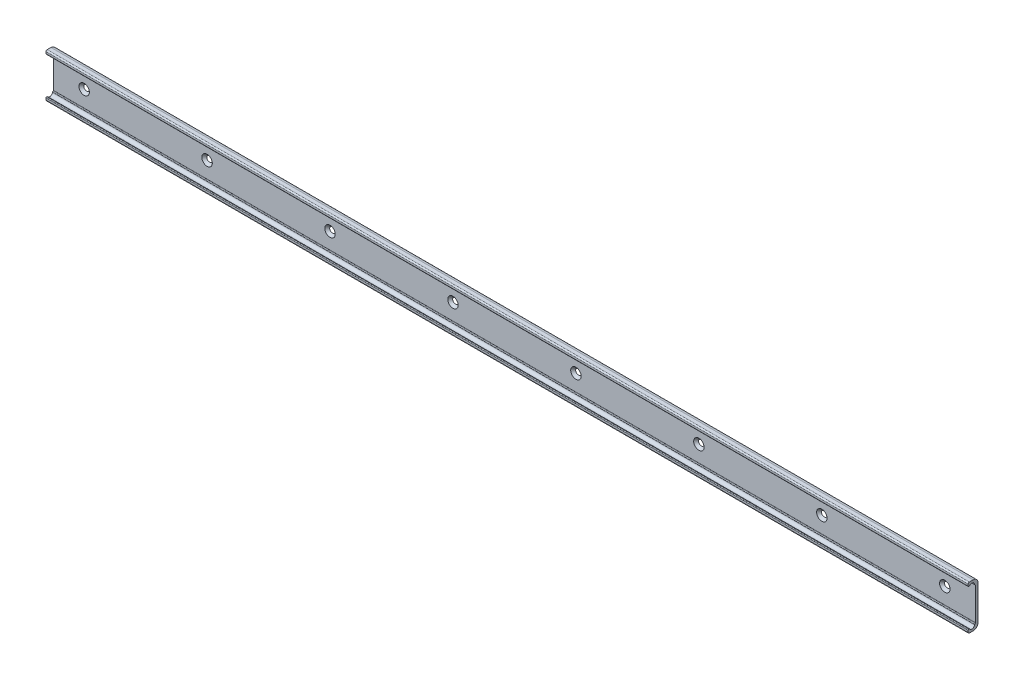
ISO-10303-21;
HEADER;
FILE_DESCRIPTION(('STEP AP214'),'2;1');
FILE_NAME('part.step','',(''),(''),'','','');
FILE_SCHEMA(('AUTOMOTIVE_DESIGN { 1 0 10303 214 1 1 1 1 }'));
ENDSEC;
DATA;
#1=APPLICATION_CONTEXT('core data for automotive mechanical design processes');
#2=APPLICATION_PROTOCOL_DEFINITION('international standard','automotive_design',2000,#1);
#3=PRODUCT_CONTEXT('',#1,'mechanical');
#4=PRODUCT('Part','Part','',(#3));
#5=PRODUCT_RELATED_PRODUCT_CATEGORY('part','',(#4));
#6=PRODUCT_DEFINITION_FORMATION('','',#4);
#7=PRODUCT_DEFINITION_CONTEXT('part definition',#1,'design');
#8=PRODUCT_DEFINITION('design','',#6,#7);
#9=PRODUCT_DEFINITION_SHAPE('','',#8);
#10=(LENGTH_UNIT() NAMED_UNIT(*) SI_UNIT(.MILLI.,.METRE.));
#11=(NAMED_UNIT(*) PLANE_ANGLE_UNIT() SI_UNIT($,.RADIAN.));
#12=(NAMED_UNIT(*) SI_UNIT($,.STERADIAN.) SOLID_ANGLE_UNIT());
#13=UNCERTAINTY_MEASURE_WITH_UNIT(LENGTH_MEASURE(1.E-05),#10,'distance_accuracy_value','');
#14=(GEOMETRIC_REPRESENTATION_CONTEXT(3) GLOBAL_UNCERTAINTY_ASSIGNED_CONTEXT((#13)) GLOBAL_UNIT_ASSIGNED_CONTEXT((#10,
#11,#12)) REPRESENTATION_CONTEXT('',''));
#15=CARTESIAN_POINT('',(0.,0.,0.));
#16=DIRECTION('',(0.,0.,1.));
#17=DIRECTION('',(1.,0.,0.));
#18=AXIS2_PLACEMENT_3D('',#15,#16,#17);
#19=CARTESIAN_POINT('',(625.,-13.1928934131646,1.9999998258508));
#20=DIRECTION('',(0.,0.,1.));
#21=DIRECTION('',(0.,1.,0.));
#22=AXIS2_PLACEMENT_3D('',#19,#20,#21);
#23=PLANE('',#22);
#24=DIRECTION('',(0.,1.,0.));
#25=VECTOR('',#24,1.);
#26=CARTESIAN_POINT('',(-25.,-13.1928934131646,1.9999998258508));
#27=LINE('',#26,#25);
#28=CARTESIAN_POINT('',(-25.,-13.1928934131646,1.9999998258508));
#29=VERTEX_POINT('',#28);
#30=CARTESIAN_POINT('',(-25.,13.1928934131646,1.9999998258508));
#31=VERTEX_POINT('',#30);
#32=EDGE_CURVE('E339',#29,#31,#27,.T.);
#33=ORIENTED_EDGE('',*,*,#32,.F.);
#34=DIRECTION('',(-1.,0.,0.));
#35=VECTOR('',#34,1.);
#36=CARTESIAN_POINT('',(625.,-13.1928934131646,1.9999998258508));
#37=LINE('',#36,#35);
#38=CARTESIAN_POINT('',(725.,-13.1928934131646,1.9999998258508));
#39=VERTEX_POINT('',#38);
#40=EDGE_CURVE('E389',#39,#29,#37,.T.);
#41=ORIENTED_EDGE('',*,*,#40,.F.);
#42=DIRECTION('',(0.,-1.,0.));
#43=VECTOR('',#42,1.);
#44=CARTESIAN_POINT('',(725.,13.1928934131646,1.9999998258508));
#45=LINE('',#44,#43);
#46=CARTESIAN_POINT('',(725.,13.1928934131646,1.9999998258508));
#47=VERTEX_POINT('',#46);
#48=EDGE_CURVE('E224',#47,#39,#45,.T.);
#49=ORIENTED_EDGE('',*,*,#48,.F.);
#50=DIRECTION('',(-1.,0.,0.));
#51=VECTOR('',#50,1.);
#52=CARTESIAN_POINT('',(625.,13.1928934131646,1.9999998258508));
#53=LINE('',#52,#51);
#54=EDGE_CURVE('E387',#47,#31,#53,.T.);
#55=ORIENTED_EDGE('',*,*,#54,.T.);
#56=EDGE_LOOP('',(#33,#41,#49,#55));
#57=FACE_BOUND('',#56,.T.);
#58=CARTESIAN_POINT('',(0.,0.,1.9999998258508));
#59=DIRECTION('',(0.,0.,1.));
#60=DIRECTION('',(0.,1.,0.));
#61=AXIS2_PLACEMENT_3D('',#58,#59,#60);
#62=CIRCLE('',#61,4.25);
#63=CARTESIAN_POINT('',(0.,4.25,1.99999982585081));
#64=VERTEX_POINT('',#63);
#65=EDGE_CURVE('E296',#64,#64,#62,.T.);
#66=ORIENTED_EDGE('',*,*,#65,.F.);
#67=EDGE_LOOP('',(#66));
#68=FACE_BOUND('',#67,.T.);
#69=CARTESIAN_POINT('',(100.,0.,1.9999998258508));
#70=DIRECTION('',(0.,0.,1.));
#71=DIRECTION('',(0.,1.,0.));
#72=AXIS2_PLACEMENT_3D('',#69,#70,#71);
#73=CIRCLE('',#72,4.25);
#74=CARTESIAN_POINT('',(100.,4.25,1.99999982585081));
#75=VERTEX_POINT('',#74);
#76=EDGE_CURVE('E290',#75,#75,#73,.T.);
#77=ORIENTED_EDGE('',*,*,#76,.F.);
#78=EDGE_LOOP('',(#77));
#79=FACE_BOUND('',#78,.T.);
#80=CARTESIAN_POINT('',(200.,0.,1.9999998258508));
#81=DIRECTION('',(0.,0.,1.));
#82=DIRECTION('',(0.,1.,0.));
#83=AXIS2_PLACEMENT_3D('',#80,#81,#82);
#84=CIRCLE('',#83,4.25);
#85=CARTESIAN_POINT('',(200.,4.25,1.99999982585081));
#86=VERTEX_POINT('',#85);
#87=EDGE_CURVE('E284',#86,#86,#84,.T.);
#88=ORIENTED_EDGE('',*,*,#87,.F.);
#89=EDGE_LOOP('',(#88));
#90=FACE_BOUND('',#89,.T.);
#91=CARTESIAN_POINT('',(300.,0.,1.9999998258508));
#92=DIRECTION('',(0.,0.,1.));
#93=DIRECTION('',(0.,1.,0.));
#94=AXIS2_PLACEMENT_3D('',#91,#92,#93);
#95=CIRCLE('',#94,4.25);
#96=CARTESIAN_POINT('',(300.,4.25,1.99999982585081));
#97=VERTEX_POINT('',#96);
#98=EDGE_CURVE('E278',#97,#97,#95,.T.);
#99=ORIENTED_EDGE('',*,*,#98,.F.);
#100=EDGE_LOOP('',(#99));
#101=FACE_BOUND('',#100,.T.);
#102=CARTESIAN_POINT('',(400.,0.,1.9999998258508));
#103=DIRECTION('',(0.,0.,1.));
#104=DIRECTION('',(0.,1.,0.));
#105=AXIS2_PLACEMENT_3D('',#102,#103,#104);
#106=CIRCLE('',#105,4.25);
#107=CARTESIAN_POINT('',(400.,4.25,1.99999982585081));
#108=VERTEX_POINT('',#107);
#109=EDGE_CURVE('E272',#108,#108,#106,.T.);
#110=ORIENTED_EDGE('',*,*,#109,.F.);
#111=EDGE_LOOP('',(#110));
#112=FACE_BOUND('',#111,.T.);
#113=CARTESIAN_POINT('',(500.,0.,1.9999998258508));
#114=DIRECTION('',(0.,0.,1.));
#115=DIRECTION('',(0.,1.,0.));
#116=AXIS2_PLACEMENT_3D('',#113,#114,#115);
#117=CIRCLE('',#116,4.25);
#118=CARTESIAN_POINT('',(500.,4.25,1.99999982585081));
#119=VERTEX_POINT('',#118);
#120=EDGE_CURVE('E266',#119,#119,#117,.T.);
#121=ORIENTED_EDGE('',*,*,#120,.F.);
#122=EDGE_LOOP('',(#121));
#123=FACE_BOUND('',#122,.T.);
#124=CARTESIAN_POINT('',(600.,0.,1.9999998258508));
#125=DIRECTION('',(0.,0.,1.));
#126=DIRECTION('',(0.,1.,0.));
#127=AXIS2_PLACEMENT_3D('',#124,#125,#126);
#128=CIRCLE('',#127,4.25);
#129=CARTESIAN_POINT('',(600.,4.25,1.99999982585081));
#130=VERTEX_POINT('',#129);
#131=EDGE_CURVE('E260',#130,#130,#128,.T.);
#132=ORIENTED_EDGE('',*,*,#131,.F.);
#133=EDGE_LOOP('',(#132));
#134=FACE_BOUND('',#133,.T.);
#135=CARTESIAN_POINT('',(700.,0.,1.9999998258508));
#136=DIRECTION('',(0.,0.,-1.));
#137=DIRECTION('',(-1.,0.,0.));
#138=AXIS2_PLACEMENT_3D('',#135,#136,#137);
#139=CIRCLE('',#138,4.25);
#140=CARTESIAN_POINT('',(695.75,0.,1.9999998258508));
#141=VERTEX_POINT('',#140);
#142=EDGE_CURVE('E192',#141,#141,#139,.T.);
#143=ORIENTED_EDGE('',*,*,#142,.T.);
#144=EDGE_LOOP('',(#143));
#145=FACE_BOUND('',#144,.T.);
#146=ADVANCED_FACE('F14',(#57,#68,#79,#90,#101,#112,#123,#134,#145),#23,.T.);
#147=CARTESIAN_POINT('',(625.,-14.,0.));
#148=DIRECTION('',(0.,0.,-1.));
#149=DIRECTION('',(-1.,0.,0.));
#150=AXIS2_PLACEMENT_3D('',#147,#148,#149);
#151=PLANE('',#150);
#152=DIRECTION('',(0.,-1.,0.));
#153=VECTOR('',#152,1.);
#154=CARTESIAN_POINT('',(-25.,-14.,0.));
#155=LINE('',#154,#153);
#156=CARTESIAN_POINT('',(-25.,14.,0.));
#157=VERTEX_POINT('',#156);
#158=CARTESIAN_POINT('',(-25.,-14.,0.));
#159=VERTEX_POINT('',#158);
#160=EDGE_CURVE('E303',#157,#159,#155,.T.);
#161=ORIENTED_EDGE('',*,*,#160,.F.);
#162=DIRECTION('',(-1.,0.,0.));
#163=VECTOR('',#162,1.);
#164=CARTESIAN_POINT('',(625.,14.,0.));
#165=LINE('',#164,#163);
#166=CARTESIAN_POINT('',(725.,14.,0.));
#167=VERTEX_POINT('',#166);
#168=EDGE_CURVE('E18',#167,#157,#165,.T.);
#169=ORIENTED_EDGE('',*,*,#168,.F.);
#170=DIRECTION('',(0.,1.,0.));
#171=VECTOR('',#170,1.);
#172=CARTESIAN_POINT('',(725.,-14.,0.));
#173=LINE('',#172,#171);
#174=CARTESIAN_POINT('',(725.,-14.,0.));
#175=VERTEX_POINT('',#174);
#176=EDGE_CURVE('E191',#175,#167,#173,.T.);
#177=ORIENTED_EDGE('',*,*,#176,.F.);
#178=DIRECTION('',(-1.,0.,0.));
#179=VECTOR('',#178,1.);
#180=CARTESIAN_POINT('',(625.,-14.,0.));
#181=LINE('',#180,#179);
#182=EDGE_CURVE('E410',#175,#159,#181,.T.);
#183=ORIENTED_EDGE('',*,*,#182,.T.);
#184=EDGE_LOOP('',(#161,#169,#177,#183));
#185=FACE_BOUND('',#184,.T.);
#186=CARTESIAN_POINT('',(0.,0.,-1.74149182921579E-07));
#187=DIRECTION('',(0.,0.,1.));
#188=DIRECTION('',(0.,1.,0.));
#189=AXIS2_PLACEMENT_3D('',#186,#187,#188);
#190=CIRCLE('',#189,2.25);
#191=CARTESIAN_POINT('',(0.,2.25,-1.74149182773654E-07));
#192=VERTEX_POINT('',#191);
#193=EDGE_CURVE('E299',#192,#192,#190,.T.);
#194=ORIENTED_EDGE('',*,*,#193,.T.);
#195=EDGE_LOOP('',(#194));
#196=FACE_BOUND('',#195,.T.);
#197=CARTESIAN_POINT('',(100.,0.,-1.74149182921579E-07));
#198=DIRECTION('',(0.,0.,1.));
#199=DIRECTION('',(0.,1.,0.));
#200=AXIS2_PLACEMENT_3D('',#197,#198,#199);
#201=CIRCLE('',#200,2.25);
#202=CARTESIAN_POINT('',(100.,2.25,-1.74149182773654E-07));
#203=VERTEX_POINT('',#202);
#204=EDGE_CURVE('E293',#203,#203,#201,.T.);
#205=ORIENTED_EDGE('',*,*,#204,.T.);
#206=EDGE_LOOP('',(#205));
#207=FACE_BOUND('',#206,.T.);
#208=CARTESIAN_POINT('',(200.,0.,-1.74149182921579E-07));
#209=DIRECTION('',(0.,0.,1.));
#210=DIRECTION('',(0.,1.,0.));
#211=AXIS2_PLACEMENT_3D('',#208,#209,#210);
#212=CIRCLE('',#211,2.25);
#213=CARTESIAN_POINT('',(200.,2.25,-1.74149182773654E-07));
#214=VERTEX_POINT('',#213);
#215=EDGE_CURVE('E287',#214,#214,#212,.T.);
#216=ORIENTED_EDGE('',*,*,#215,.T.);
#217=EDGE_LOOP('',(#216));
#218=FACE_BOUND('',#217,.T.);
#219=CARTESIAN_POINT('',(300.,0.,-1.74149182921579E-07));
#220=DIRECTION('',(0.,0.,1.));
#221=DIRECTION('',(0.,1.,0.));
#222=AXIS2_PLACEMENT_3D('',#219,#220,#221);
#223=CIRCLE('',#222,2.25);
#224=CARTESIAN_POINT('',(300.,2.25,-1.74149182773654E-07));
#225=VERTEX_POINT('',#224);
#226=EDGE_CURVE('E281',#225,#225,#223,.T.);
#227=ORIENTED_EDGE('',*,*,#226,.T.);
#228=EDGE_LOOP('',(#227));
#229=FACE_BOUND('',#228,.T.);
#230=CARTESIAN_POINT('',(400.,0.,-1.74149182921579E-07));
#231=DIRECTION('',(0.,0.,1.));
#232=DIRECTION('',(0.,1.,0.));
#233=AXIS2_PLACEMENT_3D('',#230,#231,#232);
#234=CIRCLE('',#233,2.25);
#235=CARTESIAN_POINT('',(400.,2.25,-1.74149182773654E-07));
#236=VERTEX_POINT('',#235);
#237=EDGE_CURVE('E275',#236,#236,#234,.T.);
#238=ORIENTED_EDGE('',*,*,#237,.T.);
#239=EDGE_LOOP('',(#238));
#240=FACE_BOUND('',#239,.T.);
#241=CARTESIAN_POINT('',(500.,0.,-1.74149182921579E-07));
#242=DIRECTION('',(0.,0.,1.));
#243=DIRECTION('',(0.,1.,0.));
#244=AXIS2_PLACEMENT_3D('',#241,#242,#243);
#245=CIRCLE('',#244,2.25);
#246=CARTESIAN_POINT('',(500.,2.25,-1.74149182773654E-07));
#247=VERTEX_POINT('',#246);
#248=EDGE_CURVE('E269',#247,#247,#245,.T.);
#249=ORIENTED_EDGE('',*,*,#248,.T.);
#250=EDGE_LOOP('',(#249));
#251=FACE_BOUND('',#250,.T.);
#252=CARTESIAN_POINT('',(600.,0.,-1.74149182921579E-07));
#253=DIRECTION('',(0.,0.,1.));
#254=DIRECTION('',(0.,1.,0.));
#255=AXIS2_PLACEMENT_3D('',#252,#253,#254);
#256=CIRCLE('',#255,2.25);
#257=CARTESIAN_POINT('',(600.,2.25,-1.74149182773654E-07));
#258=VERTEX_POINT('',#257);
#259=EDGE_CURVE('E263',#258,#258,#256,.T.);
#260=ORIENTED_EDGE('',*,*,#259,.T.);
#261=EDGE_LOOP('',(#260));
#262=FACE_BOUND('',#261,.T.);
#263=CARTESIAN_POINT('',(700.,0.,-1.74149183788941E-07));
#264=DIRECTION('',(0.,0.,-1.));
#265=DIRECTION('',(-1.,0.,0.));
#266=AXIS2_PLACEMENT_3D('',#263,#264,#265);
#267=CIRCLE('',#266,2.25);
#268=CARTESIAN_POINT('',(697.75,0.,-1.74149183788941E-07));
#269=VERTEX_POINT('',#268);
#270=EDGE_CURVE('E195',#269,#269,#267,.T.);
#271=ORIENTED_EDGE('',*,*,#270,.F.);
#272=EDGE_LOOP('',(#271));
#273=FACE_BOUND('',#272,.T.);
#274=ADVANCED_FACE('F414',(#185,#196,#207,#218,#229,#240,#251,#262,#273),#151,.T.);
#275=CARTESIAN_POINT('',(625.,14.,4.));
#276=DIRECTION('',(-1.,0.,0.));
#277=DIRECTION('',(0.,0.,1.));
#278=AXIS2_PLACEMENT_3D('',#275,#276,#277);
#279=CYLINDRICAL_SURFACE('',#278,4.);
#280=CARTESIAN_POINT('',(-25.,14.,4.));
#281=DIRECTION('',(-1.,0.,0.));
#282=DIRECTION('',(0.,0.,1.));
#283=AXIS2_PLACEMENT_3D('',#280,#281,#282);
#284=CIRCLE('',#283,4.);
#285=CARTESIAN_POINT('',(-25.,18.,4.));
#286=VERTEX_POINT('',#285);
#287=EDGE_CURVE('E178',#286,#157,#284,.T.);
#288=ORIENTED_EDGE('',*,*,#287,.F.);
#289=DIRECTION('',(-1.,0.,0.));
#290=VECTOR('',#289,1.);
#291=CARTESIAN_POINT('',(625.,18.,4.));
#292=LINE('',#291,#290);
#293=CARTESIAN_POINT('',(725.,18.,4.));
#294=VERTEX_POINT('',#293);
#295=EDGE_CURVE('E9',#294,#286,#292,.T.);
#296=ORIENTED_EDGE('',*,*,#295,.F.);
#297=CARTESIAN_POINT('',(725.,14.,4.));
#298=DIRECTION('',(1.,0.,0.));
#299=DIRECTION('',(0.,0.,-1.));
#300=AXIS2_PLACEMENT_3D('',#297,#298,#299);
#301=CIRCLE('',#300,4.);
#302=EDGE_CURVE('E176',#167,#294,#301,.T.);
#303=ORIENTED_EDGE('',*,*,#302,.F.);
#304=ORIENTED_EDGE('',*,*,#168,.T.);
#305=EDGE_LOOP('',(#288,#296,#303,#304));
#306=FACE_BOUND('',#305,.T.);
#307=ADVANCED_FACE('F16',(#306),#279,.T.);
#308=CARTESIAN_POINT('',(625.,18.,7.));
#309=DIRECTION('',(0.,1.,0.));
#310=DIRECTION('',(-1.,0.,0.));
#311=AXIS2_PLACEMENT_3D('',#308,#309,#310);
#312=PLANE('',#311);
#313=DIRECTION('',(0.,0.,-1.));
#314=VECTOR('',#313,1.);
#315=CARTESIAN_POINT('',(-25.,18.,7.));
#316=LINE('',#315,#314);
#317=CARTESIAN_POINT('',(-25.,18.,7.));
#318=VERTEX_POINT('',#317);
#319=EDGE_CURVE('E368',#318,#286,#316,.T.);
#320=ORIENTED_EDGE('',*,*,#319,.F.);
#321=DIRECTION('',(-1.,0.,0.));
#322=VECTOR('',#321,1.);
#323=CARTESIAN_POINT('',(625.,18.,7.));
#324=LINE('',#323,#322);
#325=CARTESIAN_POINT('',(725.,18.,7.));
#326=VERTEX_POINT('',#325);
#327=EDGE_CURVE('E23',#326,#318,#324,.T.);
#328=ORIENTED_EDGE('',*,*,#327,.F.);
#329=DIRECTION('',(0.,0.,1.));
#330=VECTOR('',#329,1.);
#331=CARTESIAN_POINT('',(725.,18.,4.));
#332=LINE('',#331,#330);
#333=EDGE_CURVE('E181',#294,#326,#332,.T.);
#334=ORIENTED_EDGE('',*,*,#333,.F.);
#335=ORIENTED_EDGE('',*,*,#295,.T.);
#336=EDGE_LOOP('',(#320,#328,#334,#335));
#337=FACE_BOUND('',#336,.T.);
#338=ADVANCED_FACE('F182',(#337),#312,.T.);
#339=CARTESIAN_POINT('',(625.,17.,7.));
#340=DIRECTION('',(-1.,0.,0.));
#341=DIRECTION('',(0.,0.,1.));
#342=AXIS2_PLACEMENT_3D('',#339,#340,#341);
#343=CYLINDRICAL_SURFACE('',#342,1.);
#344=CARTESIAN_POINT('',(-25.,17.,7.));
#345=DIRECTION('',(-1.,0.,0.));
#346=DIRECTION('',(0.,0.,1.));
#347=AXIS2_PLACEMENT_3D('',#344,#345,#346);
#348=CIRCLE('',#347,1.);
#349=CARTESIAN_POINT('',(-25.,17.,8.));
#350=VERTEX_POINT('',#349);
#351=EDGE_CURVE('E366',#350,#318,#348,.T.);
#352=ORIENTED_EDGE('',*,*,#351,.F.);
#353=DIRECTION('',(-1.,0.,0.));
#354=VECTOR('',#353,1.);
#355=CARTESIAN_POINT('',(625.,17.,8.));
#356=LINE('',#355,#354);
#357=CARTESIAN_POINT('',(725.,17.,8.));
#358=VERTEX_POINT('',#357);
#359=EDGE_CURVE('E371',#358,#350,#356,.T.);
#360=ORIENTED_EDGE('',*,*,#359,.F.);
#361=CARTESIAN_POINT('',(725.,17.,7.));
#362=DIRECTION('',(1.,0.,0.));
#363=DIRECTION('',(0.,0.,-1.));
#364=AXIS2_PLACEMENT_3D('',#361,#362,#363);
#365=CIRCLE('',#364,1.);
#366=EDGE_CURVE('E185',#326,#358,#365,.T.);
#367=ORIENTED_EDGE('',*,*,#366,.F.);
#368=ORIENTED_EDGE('',*,*,#327,.T.);
#369=EDGE_LOOP('',(#352,#360,#367,#368));
#370=FACE_BOUND('',#369,.T.);
#371=ADVANCED_FACE('F419',(#370),#343,.T.);
#372=CARTESIAN_POINT('',(625.,15.55,8.));
#373=DIRECTION('',(0.,0.,1.));
#374=DIRECTION('',(1.,0.,0.));
#375=AXIS2_PLACEMENT_3D('',#372,#373,#374);
#376=PLANE('',#375);
#377=DIRECTION('',(0.,1.,0.));
#378=VECTOR('',#377,1.);
#379=CARTESIAN_POINT('',(-25.,15.55,8.));
#380=LINE('',#379,#378);
#381=CARTESIAN_POINT('',(-25.,15.55,8.));
#382=VERTEX_POINT('',#381);
#383=EDGE_CURVE('E363',#382,#350,#380,.T.);
#384=ORIENTED_EDGE('',*,*,#383,.F.);
#385=DIRECTION('',(-1.,0.,0.));
#386=VECTOR('',#385,1.);
#387=CARTESIAN_POINT('',(625.,15.55,8.));
#388=LINE('',#387,#386);
#389=CARTESIAN_POINT('',(725.,15.55,8.));
#390=VERTEX_POINT('',#389);
#391=EDGE_CURVE('E373',#390,#382,#388,.T.);
#392=ORIENTED_EDGE('',*,*,#391,.F.);
#393=DIRECTION('',(0.,-1.,0.));
#394=VECTOR('',#393,1.);
#395=CARTESIAN_POINT('',(725.,17.,8.));
#396=LINE('',#395,#394);
#397=EDGE_CURVE('E200',#358,#390,#396,.T.);
#398=ORIENTED_EDGE('',*,*,#397,.F.);
#399=ORIENTED_EDGE('',*,*,#359,.T.);
#400=EDGE_LOOP('',(#384,#392,#398,#399));
#401=FACE_BOUND('',#400,.T.);
#402=ADVANCED_FACE('F423',(#401),#376,.T.);
#403=CARTESIAN_POINT('',(625.,15.5499998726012,7.5));
#404=DIRECTION('',(-1.,0.,0.));
#405=DIRECTION('',(0.,0.,1.));
#406=AXIS2_PLACEMENT_3D('',#403,#404,#405);
#407=CYLINDRICAL_SURFACE('',#406,0.500000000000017);
#408=CARTESIAN_POINT('',(-25.,15.5499998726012,7.5));
#409=DIRECTION('',(-1.,0.,0.));
#410=DIRECTION('',(0.,0.,1.));
#411=AXIS2_PLACEMENT_3D('',#408,#409,#410);
#412=CIRCLE('',#411,0.500000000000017);
#413=CARTESIAN_POINT('',(-25.,15.0499998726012,7.49999995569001));
#414=VERTEX_POINT('',#413);
#415=EDGE_CURVE('E360',#414,#382,#412,.T.);
#416=ORIENTED_EDGE('',*,*,#415,.F.);
#417=DIRECTION('',(-1.,0.,0.));
#418=VECTOR('',#417,1.);
#419=CARTESIAN_POINT('',(625.,15.0499998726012,7.49999995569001));
#420=LINE('',#419,#418);
#421=CARTESIAN_POINT('',(725.,15.0499998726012,7.49999995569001));
#422=VERTEX_POINT('',#421);
#423=EDGE_CURVE('E375',#422,#414,#420,.T.);
#424=ORIENTED_EDGE('',*,*,#423,.F.);
#425=CARTESIAN_POINT('',(725.,15.5499998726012,7.5));
#426=DIRECTION('',(1.,0.,0.));
#427=DIRECTION('',(0.,0.,-1.));
#428=AXIS2_PLACEMENT_3D('',#425,#426,#427);
#429=CIRCLE('',#428,0.500000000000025);
#430=EDGE_CURVE('E203',#390,#422,#429,.T.);
#431=ORIENTED_EDGE('',*,*,#430,.F.);
#432=ORIENTED_EDGE('',*,*,#391,.T.);
#433=EDGE_LOOP('',(#416,#424,#431,#432));
#434=FACE_BOUND('',#433,.T.);
#435=ADVANCED_FACE('F426',(#434),#407,.T.);
#436=CARTESIAN_POINT('',(625.,15.0499998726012,7.49999995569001));
#437=DIRECTION('',(0.,-1.,0.));
#438=DIRECTION('',(1.,0.,0.));
#439=AXIS2_PLACEMENT_3D('',#436,#437,#438);
#440=PLANE('',#439);
#441=DIRECTION('',(0.,0.,1.));
#442=VECTOR('',#441,1.);
#443=CARTESIAN_POINT('',(-25.,15.0499998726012,7.49999995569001));
#444=LINE('',#443,#442);
#445=CARTESIAN_POINT('',(-25.,15.0499998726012,6.99185845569));
#446=VERTEX_POINT('',#445);
#447=EDGE_CURVE('E357',#446,#414,#444,.T.);
#448=ORIENTED_EDGE('',*,*,#447,.F.);
#449=DIRECTION('',(-1.,0.,0.));
#450=VECTOR('',#449,1.);
#451=CARTESIAN_POINT('',(625.,15.0499998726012,6.99185845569));
#452=LINE('',#451,#450);
#453=CARTESIAN_POINT('',(725.,15.0499998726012,6.99185845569));
#454=VERTEX_POINT('',#453);
#455=EDGE_CURVE('E377',#454,#446,#452,.T.);
#456=ORIENTED_EDGE('',*,*,#455,.F.);
#457=DIRECTION('',(0.,0.,-1.));
#458=VECTOR('',#457,1.);
#459=CARTESIAN_POINT('',(725.,15.0499998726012,7.49999995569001));
#460=LINE('',#459,#458);
#461=EDGE_CURVE('E206',#422,#454,#460,.T.);
#462=ORIENTED_EDGE('',*,*,#461,.F.);
#463=ORIENTED_EDGE('',*,*,#423,.T.);
#464=EDGE_LOOP('',(#448,#456,#462,#463));
#465=FACE_BOUND('',#464,.T.);
#466=ADVANCED_FACE('F431',(#465),#440,.T.);
#467=CARTESIAN_POINT('',(625.,13.899999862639,4.99999993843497));
#468=DIRECTION('',(-1.,0.,0.));
#469=DIRECTION('',(0.,0.,1.));
#470=AXIS2_PLACEMENT_3D('',#467,#468,#469);
#471=CYLINDRICAL_SURFACE('',#470,2.30000008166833);
#472=CARTESIAN_POINT('',(-25.,13.899999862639,4.99999993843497));
#473=DIRECTION('',(1.,0.,0.));
#474=DIRECTION('',(0.,0.,1.));
#475=AXIS2_PLACEMENT_3D('',#472,#473,#474);
#476=CIRCLE('',#475,2.30000008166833);
#477=CARTESIAN_POINT('',(-25.,14.3822673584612,2.75112945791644));
#478=VERTEX_POINT('',#477);
#479=EDGE_CURVE('E354',#478,#446,#476,.T.);
#480=ORIENTED_EDGE('',*,*,#479,.F.);
#481=DIRECTION('',(-1.,0.,0.));
#482=VECTOR('',#481,1.);
#483=CARTESIAN_POINT('',(625.,14.3822673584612,2.75112945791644));
#484=LINE('',#483,#482);
#485=CARTESIAN_POINT('',(725.,14.3822673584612,2.75112945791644));
#486=VERTEX_POINT('',#485);
#487=EDGE_CURVE('E379',#486,#478,#484,.T.);
#488=ORIENTED_EDGE('',*,*,#487,.F.);
#489=CARTESIAN_POINT('',(725.,13.899999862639,4.99999993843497));
#490=DIRECTION('',(-1.,0.,0.));
#491=DIRECTION('',(0.,0.,-1.));
#492=AXIS2_PLACEMENT_3D('',#489,#490,#491);
#493=CIRCLE('',#492,2.30000008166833);
#494=EDGE_CURVE('E209',#454,#486,#493,.T.);
#495=ORIENTED_EDGE('',*,*,#494,.F.);
#496=ORIENTED_EDGE('',*,*,#455,.T.);
#497=EDGE_LOOP('',(#480,#488,#495,#496));
#498=FACE_BOUND('',#497,.T.);
#499=ADVANCED_FACE('F434',(#498),#471,.F.);
#500=CARTESIAN_POINT('',(625.,14.2647621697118,2.72240648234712));
#501=DIRECTION('',(0.,-0.237449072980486,0.971399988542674));
#502=DIRECTION('',(0.,0.971399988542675,0.237449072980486));
#503=AXIS2_PLACEMENT_3D('',#500,#501,#502);
#504=PLANE('',#503);
#505=DIRECTION('',(0.,0.971399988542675,0.237449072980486));
#506=VECTOR('',#505,1.);
#507=CARTESIAN_POINT('',(-25.,14.2647621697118,2.72240648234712));
#508=LINE('',#507,#506);
#509=CARTESIAN_POINT('',(-25.,14.2647621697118,2.72240648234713));
#510=VERTEX_POINT('',#509);
#511=EDGE_CURVE('E351',#510,#478,#508,.T.);
#512=ORIENTED_EDGE('',*,*,#511,.F.);
#513=DIRECTION('',(-1.,0.,0.));
#514=VECTOR('',#513,1.);
#515=CARTESIAN_POINT('',(625.,14.2647621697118,2.72240648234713));
#516=LINE('',#515,#514);
#517=CARTESIAN_POINT('',(725.,14.2647621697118,2.72240648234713));
#518=VERTEX_POINT('',#517);
#519=EDGE_CURVE('E381',#518,#510,#516,.T.);
#520=ORIENTED_EDGE('',*,*,#519,.F.);
#521=DIRECTION('',(0.,-0.971399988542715,-0.237449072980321));
#522=VECTOR('',#521,1.);
#523=CARTESIAN_POINT('',(725.,14.3822673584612,2.75112945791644));
#524=LINE('',#523,#522);
#525=EDGE_CURVE('E212',#486,#518,#524,.T.);
#526=ORIENTED_EDGE('',*,*,#525,.F.);
#527=ORIENTED_EDGE('',*,*,#487,.T.);
#528=EDGE_LOOP('',(#512,#520,#526,#527));
#529=FACE_BOUND('',#528,.T.);
#530=ADVANCED_FACE('F439',(#529),#504,.T.);
#531=CARTESIAN_POINT('',(625.,14.3343843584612,2.2272774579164));
#532=DIRECTION('',(-1.,0.,0.));
#533=DIRECTION('',(0.,0.,1.));
#534=AXIS2_PLACEMENT_3D('',#531,#532,#533);
#535=CYLINDRICAL_SURFACE('',#534,0.49999999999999);
#536=CARTESIAN_POINT('',(-25.,14.3343843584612,2.2272774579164));
#537=DIRECTION('',(-1.,0.,0.));
#538=DIRECTION('',(0.,0.,1.));
#539=AXIS2_PLACEMENT_3D('',#536,#537,#538);
#540=CIRCLE('',#539,0.49999999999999);
#541=CARTESIAN_POINT('',(-25.,13.980830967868,2.58083084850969));
#542=VERTEX_POINT('',#541);
#543=EDGE_CURVE('E348',#542,#510,#540,.T.);
#544=ORIENTED_EDGE('',*,*,#543,.F.);
#545=DIRECTION('',(-1.,0.,0.));
#546=VECTOR('',#545,1.);
#547=CARTESIAN_POINT('',(625.,13.980830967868,2.58083084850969));
#548=LINE('',#547,#546);
#549=CARTESIAN_POINT('',(725.,13.980830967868,2.58083084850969));
#550=VERTEX_POINT('',#549);
#551=EDGE_CURVE('E383',#550,#542,#548,.T.);
#552=ORIENTED_EDGE('',*,*,#551,.F.);
#553=CARTESIAN_POINT('',(725.,14.3343843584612,2.2272774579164));
#554=DIRECTION('',(1.,0.,0.));
#555=DIRECTION('',(0.,0.,-1.));
#556=AXIS2_PLACEMENT_3D('',#553,#554,#555);
#557=CIRCLE('',#556,0.499999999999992);
#558=EDGE_CURVE('E215',#518,#550,#557,.T.);
#559=ORIENTED_EDGE('',*,*,#558,.F.);
#560=ORIENTED_EDGE('',*,*,#519,.T.);
#561=EDGE_LOOP('',(#544,#552,#559,#560));
#562=FACE_BOUND('',#561,.T.);
#563=ADVANCED_FACE('F442',(#562),#535,.T.);
#564=CARTESIAN_POINT('',(625.,13.5464468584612,2.1464464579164));
#565=DIRECTION('',(0.,-0.707107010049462,0.707106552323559));
#566=DIRECTION('',(0.,0.707106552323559,0.707107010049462));
#567=AXIS2_PLACEMENT_3D('',#564,#565,#566);
#568=PLANE('',#567);
#569=DIRECTION('',(0.,0.707106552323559,0.707107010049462));
#570=VECTOR('',#569,1.);
#571=CARTESIAN_POINT('',(-25.,13.5464468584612,2.1464464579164));
#572=LINE('',#571,#570);
#573=CARTESIAN_POINT('',(-25.,13.5464468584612,2.1464464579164));
#574=VERTEX_POINT('',#573);
#575=EDGE_CURVE('E345',#574,#542,#572,.T.);
#576=ORIENTED_EDGE('',*,*,#575,.F.);
#577=DIRECTION('',(-1.,0.,0.));
#578=VECTOR('',#577,1.);
#579=CARTESIAN_POINT('',(625.,13.5464468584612,2.1464464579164));
#580=LINE('',#579,#578);
#581=CARTESIAN_POINT('',(725.,13.5464468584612,2.1464464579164));
#582=VERTEX_POINT('',#581);
#583=EDGE_CURVE('E385',#582,#574,#580,.T.);
#584=ORIENTED_EDGE('',*,*,#583,.F.);
#585=DIRECTION('',(0.,-0.707106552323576,-0.707107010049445));
#586=VECTOR('',#585,1.);
#587=CARTESIAN_POINT('',(725.,13.980830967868,2.58083084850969));
#588=LINE('',#587,#586);
#589=EDGE_CURVE('E218',#550,#582,#588,.T.);
#590=ORIENTED_EDGE('',*,*,#589,.F.);
#591=ORIENTED_EDGE('',*,*,#551,.T.);
#592=EDGE_LOOP('',(#576,#584,#590,#591));
#593=FACE_BOUND('',#592,.T.);
#594=ADVANCED_FACE('F447',(#593),#568,.T.);
#595=CARTESIAN_POINT('',(625.,13.1928934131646,2.49999990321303));
#596=DIRECTION('',(-1.,0.,0.));
#597=DIRECTION('',(0.,0.,1.));
#598=AXIS2_PLACEMENT_3D('',#595,#596,#597);
#599=CYLINDRICAL_SURFACE('',#598,0.500000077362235);
#600=CARTESIAN_POINT('',(-25.,13.1928934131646,2.49999990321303));
#601=DIRECTION('',(1.,0.,0.));
#602=DIRECTION('',(0.,0.,1.));
#603=AXIS2_PLACEMENT_3D('',#600,#601,#602);
#604=CIRCLE('',#603,0.500000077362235);
#605=EDGE_CURVE('E342',#31,#574,#604,.T.);
#606=ORIENTED_EDGE('',*,*,#605,.F.);
#607=ORIENTED_EDGE('',*,*,#54,.F.);
#608=CARTESIAN_POINT('',(725.,13.1928934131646,2.49999990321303));
#609=DIRECTION('',(-1.,0.,0.));
#610=DIRECTION('',(0.,0.,-1.));
#611=AXIS2_PLACEMENT_3D('',#608,#609,#610);
#612=CIRCLE('',#611,0.500000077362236);
#613=EDGE_CURVE('E221',#582,#47,#612,.T.);
#614=ORIENTED_EDGE('',*,*,#613,.F.);
#615=ORIENTED_EDGE('',*,*,#583,.T.);
#616=EDGE_LOOP('',(#606,#607,#614,#615));
#617=FACE_BOUND('',#616,.T.);
#618=ADVANCED_FACE('F450',(#617),#599,.F.);
#619=CARTESIAN_POINT('',(625.,-13.1928934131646,2.49999990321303));
#620=DIRECTION('',(-1.,0.,0.));
#621=DIRECTION('',(0.,0.,1.));
#622=AXIS2_PLACEMENT_3D('',#619,#620,#621);
#623=CYLINDRICAL_SURFACE('',#622,0.500000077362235);
#624=CARTESIAN_POINT('',(-25.,-13.1928934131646,2.49999990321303));
#625=DIRECTION('',(1.,0.,0.));
#626=DIRECTION('',(0.,0.,-1.));
#627=AXIS2_PLACEMENT_3D('',#624,#625,#626);
#628=CIRCLE('',#627,0.500000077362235);
#629=CARTESIAN_POINT('',(-25.,-13.5464468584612,2.1464464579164));
#630=VERTEX_POINT('',#629);
#631=EDGE_CURVE('E336',#630,#29,#628,.T.);
#632=ORIENTED_EDGE('',*,*,#631,.F.);
#633=DIRECTION('',(-1.,0.,0.));
#634=VECTOR('',#633,1.);
#635=CARTESIAN_POINT('',(625.,-13.5464468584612,2.1464464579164));
#636=LINE('',#635,#634);
#637=CARTESIAN_POINT('',(725.,-13.5464468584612,2.1464464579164));
#638=VERTEX_POINT('',#637);
#639=EDGE_CURVE('E391',#638,#630,#636,.T.);
#640=ORIENTED_EDGE('',*,*,#639,.F.);
#641=CARTESIAN_POINT('',(725.,-13.1928934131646,2.49999990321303));
#642=DIRECTION('',(-1.,0.,0.));
#643=DIRECTION('',(0.,0.,-1.));
#644=AXIS2_PLACEMENT_3D('',#641,#642,#643);
#645=CIRCLE('',#644,0.500000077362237);
#646=EDGE_CURVE('E227',#39,#638,#645,.T.);
#647=ORIENTED_EDGE('',*,*,#646,.F.);
#648=ORIENTED_EDGE('',*,*,#40,.T.);
#649=EDGE_LOOP('',(#632,#640,#647,#648));
#650=FACE_BOUND('',#649,.T.);
#651=ADVANCED_FACE('F458',(#650),#623,.F.);
#652=CARTESIAN_POINT('',(625.,-13.5464468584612,2.1464464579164));
#653=DIRECTION('',(0.,0.707107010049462,0.707106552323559));
#654=DIRECTION('',(0.,0.707106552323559,-0.707107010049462));
#655=AXIS2_PLACEMENT_3D('',#652,#653,#654);
#656=PLANE('',#655);
#657=DIRECTION('',(0.,0.707106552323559,-0.707107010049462));
#658=VECTOR('',#657,1.);
#659=CARTESIAN_POINT('',(-25.,-13.5464468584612,2.1464464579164));
#660=LINE('',#659,#658);
#661=CARTESIAN_POINT('',(-25.,-13.980830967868,2.58083084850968));
#662=VERTEX_POINT('',#661);
#663=EDGE_CURVE('E333',#662,#630,#660,.T.);
#664=ORIENTED_EDGE('',*,*,#663,.F.);
#665=DIRECTION('',(-1.,0.,0.));
#666=VECTOR('',#665,1.);
#667=CARTESIAN_POINT('',(625.,-13.980830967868,2.58083084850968));
#668=LINE('',#667,#666);
#669=CARTESIAN_POINT('',(725.,-13.980830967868,2.58083084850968));
#670=VERTEX_POINT('',#669);
#671=EDGE_CURVE('E393',#670,#662,#668,.T.);
#672=ORIENTED_EDGE('',*,*,#671,.F.);
#673=DIRECTION('',(0.,-0.70710655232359,0.707107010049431));
#674=VECTOR('',#673,1.);
#675=CARTESIAN_POINT('',(725.,-13.5464468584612,2.1464464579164));
#676=LINE('',#675,#674);
#677=EDGE_CURVE('E230',#638,#670,#676,.T.);
#678=ORIENTED_EDGE('',*,*,#677,.F.);
#679=ORIENTED_EDGE('',*,*,#639,.T.);
#680=EDGE_LOOP('',(#664,#672,#678,#679));
#681=FACE_BOUND('',#680,.T.);
#682=ADVANCED_FACE('F463',(#681),#656,.T.);
#683=CARTESIAN_POINT('',(625.,-14.3343843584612,2.22727745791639));
#684=DIRECTION('',(-1.,0.,0.));
#685=DIRECTION('',(0.,0.,1.));
#686=AXIS2_PLACEMENT_3D('',#683,#684,#685);
#687=CYLINDRICAL_SURFACE('',#686,0.49999999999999);
#688=CARTESIAN_POINT('',(-25.,-14.3343843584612,2.22727745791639));
#689=DIRECTION('',(-1.,0.,0.));
#690=DIRECTION('',(0.,0.,-1.));
#691=AXIS2_PLACEMENT_3D('',#688,#689,#690);
#692=CIRCLE('',#691,0.49999999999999);
#693=CARTESIAN_POINT('',(-25.,-14.2647621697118,2.72240648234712));
#694=VERTEX_POINT('',#693);
#695=EDGE_CURVE('E330',#694,#662,#692,.T.);
#696=ORIENTED_EDGE('',*,*,#695,.F.);
#697=DIRECTION('',(-1.,0.,0.));
#698=VECTOR('',#697,1.);
#699=CARTESIAN_POINT('',(625.,-14.2647621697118,2.72240648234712));
#700=LINE('',#699,#698);
#701=CARTESIAN_POINT('',(725.,-14.2647621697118,2.72240648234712));
#702=VERTEX_POINT('',#701);
#703=EDGE_CURVE('E395',#702,#694,#700,.T.);
#704=ORIENTED_EDGE('',*,*,#703,.F.);
#705=CARTESIAN_POINT('',(725.,-14.3343843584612,2.22727745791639));
#706=DIRECTION('',(1.,0.,0.));
#707=DIRECTION('',(0.,0.,-1.));
#708=AXIS2_PLACEMENT_3D('',#705,#706,#707);
#709=CIRCLE('',#708,0.499999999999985);
#710=EDGE_CURVE('E233',#670,#702,#709,.T.);
#711=ORIENTED_EDGE('',*,*,#710,.F.);
#712=ORIENTED_EDGE('',*,*,#671,.T.);
#713=EDGE_LOOP('',(#696,#704,#711,#712));
#714=FACE_BOUND('',#713,.T.);
#715=ADVANCED_FACE('F466',(#714),#687,.T.);
#716=CARTESIAN_POINT('',(625.,-14.2647621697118,2.72240648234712));
#717=DIRECTION('',(0.,0.237449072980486,0.971399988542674));
#718=DIRECTION('',(0.,0.971399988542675,-0.237449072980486));
#719=AXIS2_PLACEMENT_3D('',#716,#717,#718);
#720=PLANE('',#719);
#721=DIRECTION('',(0.,0.971399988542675,-0.237449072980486));
#722=VECTOR('',#721,1.);
#723=CARTESIAN_POINT('',(-25.,-14.2647621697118,2.72240648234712));
#724=LINE('',#723,#722);
#725=CARTESIAN_POINT('',(-25.,-14.3822673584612,2.75112945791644));
#726=VERTEX_POINT('',#725);
#727=EDGE_CURVE('E327',#726,#694,#724,.T.);
#728=ORIENTED_EDGE('',*,*,#727,.F.);
#729=DIRECTION('',(-1.,0.,0.));
#730=VECTOR('',#729,1.);
#731=CARTESIAN_POINT('',(625.,-14.3822673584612,2.75112945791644));
#732=LINE('',#731,#730);
#733=CARTESIAN_POINT('',(725.,-14.3822673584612,2.75112945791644));
#734=VERTEX_POINT('',#733);
#735=EDGE_CURVE('E397',#734,#726,#732,.T.);
#736=ORIENTED_EDGE('',*,*,#735,.F.);
#737=DIRECTION('',(0.,-0.971399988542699,0.237449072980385));
#738=VECTOR('',#737,1.);
#739=CARTESIAN_POINT('',(725.,-14.2647621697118,2.72240648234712));
#740=LINE('',#739,#738);
#741=EDGE_CURVE('E236',#702,#734,#740,.T.);
#742=ORIENTED_EDGE('',*,*,#741,.F.);
#743=ORIENTED_EDGE('',*,*,#703,.T.);
#744=EDGE_LOOP('',(#728,#736,#742,#743));
#745=FACE_BOUND('',#744,.T.);
#746=ADVANCED_FACE('F471',(#745),#720,.T.);
#747=CARTESIAN_POINT('',(625.,-13.899999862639,4.99999993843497));
#748=DIRECTION('',(-1.,0.,0.));
#749=DIRECTION('',(0.,0.,1.));
#750=AXIS2_PLACEMENT_3D('',#747,#748,#749);
#751=CYLINDRICAL_SURFACE('',#750,2.30000008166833);
#752=CARTESIAN_POINT('',(-25.,-13.899999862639,4.99999993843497));
#753=DIRECTION('',(1.,0.,0.));
#754=DIRECTION('',(0.,0.,-1.));
#755=AXIS2_PLACEMENT_3D('',#752,#753,#754);
#756=CIRCLE('',#755,2.30000008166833);
#757=CARTESIAN_POINT('',(-25.,-15.0499998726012,6.99185845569));
#758=VERTEX_POINT('',#757);
#759=EDGE_CURVE('E324',#758,#726,#756,.T.);
#760=ORIENTED_EDGE('',*,*,#759,.F.);
#761=DIRECTION('',(-1.,0.,0.));
#762=VECTOR('',#761,1.);
#763=CARTESIAN_POINT('',(625.,-15.0499998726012,6.99185845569));
#764=LINE('',#763,#762);
#765=CARTESIAN_POINT('',(725.,-15.0499998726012,6.99185845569));
#766=VERTEX_POINT('',#765);
#767=EDGE_CURVE('E399',#766,#758,#764,.T.);
#768=ORIENTED_EDGE('',*,*,#767,.F.);
#769=CARTESIAN_POINT('',(725.,-13.899999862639,4.99999993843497));
#770=DIRECTION('',(-1.,0.,0.));
#771=DIRECTION('',(0.,0.,-1.));
#772=AXIS2_PLACEMENT_3D('',#769,#770,#771);
#773=CIRCLE('',#772,2.30000008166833);
#774=EDGE_CURVE('E239',#734,#766,#773,.T.);
#775=ORIENTED_EDGE('',*,*,#774,.F.);
#776=ORIENTED_EDGE('',*,*,#735,.T.);
#777=EDGE_LOOP('',(#760,#768,#775,#776));
#778=FACE_BOUND('',#777,.T.);
#779=ADVANCED_FACE('F474',(#778),#751,.F.);
#780=CARTESIAN_POINT('',(625.,-15.0499998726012,7.49999995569));
#781=DIRECTION('',(0.,1.,0.));
#782=DIRECTION('',(-1.,0.,0.));
#783=AXIS2_PLACEMENT_3D('',#780,#781,#782);
#784=PLANE('',#783);
#785=DIRECTION('',(0.,0.,-1.));
#786=VECTOR('',#785,1.);
#787=CARTESIAN_POINT('',(-25.,-15.0499998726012,7.49999995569));
#788=LINE('',#787,#786);
#789=CARTESIAN_POINT('',(-25.,-15.0499998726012,7.49999995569));
#790=VERTEX_POINT('',#789);
#791=EDGE_CURVE('E321',#790,#758,#788,.T.);
#792=ORIENTED_EDGE('',*,*,#791,.F.);
#793=DIRECTION('',(-1.,0.,0.));
#794=VECTOR('',#793,1.);
#795=CARTESIAN_POINT('',(625.,-15.0499998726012,7.49999995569));
#796=LINE('',#795,#794);
#797=CARTESIAN_POINT('',(725.,-15.0499998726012,7.49999995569));
#798=VERTEX_POINT('',#797);
#799=EDGE_CURVE('E401',#798,#790,#796,.T.);
#800=ORIENTED_EDGE('',*,*,#799,.F.);
#801=DIRECTION('',(0.,0.,1.));
#802=VECTOR('',#801,1.);
#803=CARTESIAN_POINT('',(725.,-15.0499998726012,6.99185845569));
#804=LINE('',#803,#802);
#805=EDGE_CURVE('E242',#766,#798,#804,.T.);
#806=ORIENTED_EDGE('',*,*,#805,.F.);
#807=ORIENTED_EDGE('',*,*,#767,.T.);
#808=EDGE_LOOP('',(#792,#800,#806,#807));
#809=FACE_BOUND('',#808,.T.);
#810=ADVANCED_FACE('F479',(#809),#784,.T.);
#811=CARTESIAN_POINT('',(625.,-15.5499998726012,7.5));
#812=DIRECTION('',(-1.,0.,0.));
#813=DIRECTION('',(0.,0.,1.));
#814=AXIS2_PLACEMENT_3D('',#811,#812,#813);
#815=CYLINDRICAL_SURFACE('',#814,0.500000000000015);
#816=CARTESIAN_POINT('',(-25.,-15.5499998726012,7.5));
#817=DIRECTION('',(-1.,0.,0.));
#818=DIRECTION('',(0.,0.,-1.));
#819=AXIS2_PLACEMENT_3D('',#816,#817,#818);
#820=CIRCLE('',#819,0.500000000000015);
#821=CARTESIAN_POINT('',(-25.,-15.55,8.));
#822=VERTEX_POINT('',#821);
#823=EDGE_CURVE('E318',#822,#790,#820,.T.);
#824=ORIENTED_EDGE('',*,*,#823,.F.);
#825=DIRECTION('',(-1.,0.,0.));
#826=VECTOR('',#825,1.);
#827=CARTESIAN_POINT('',(625.,-15.55,8.));
#828=LINE('',#827,#826);
#829=CARTESIAN_POINT('',(725.,-15.55,8.));
#830=VERTEX_POINT('',#829);
#831=EDGE_CURVE('E403',#830,#822,#828,.T.);
#832=ORIENTED_EDGE('',*,*,#831,.F.);
#833=CARTESIAN_POINT('',(725.,-15.5499998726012,7.5));
#834=DIRECTION('',(1.,0.,0.));
#835=DIRECTION('',(0.,0.,-1.));
#836=AXIS2_PLACEMENT_3D('',#833,#834,#835);
#837=CIRCLE('',#836,0.500000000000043);
#838=EDGE_CURVE('E245',#798,#830,#837,.T.);
#839=ORIENTED_EDGE('',*,*,#838,.F.);
#840=ORIENTED_EDGE('',*,*,#799,.T.);
#841=EDGE_LOOP('',(#824,#832,#839,#840));
#842=FACE_BOUND('',#841,.T.);
#843=ADVANCED_FACE('F482',(#842),#815,.T.);
#844=CARTESIAN_POINT('',(625.,-15.55,8.));
#845=DIRECTION('',(0.,0.,1.));
#846=DIRECTION('',(1.,0.,0.));
#847=AXIS2_PLACEMENT_3D('',#844,#845,#846);
#848=PLANE('',#847);
#849=DIRECTION('',(0.,1.,0.));
#850=VECTOR('',#849,1.);
#851=CARTESIAN_POINT('',(-25.,-15.55,8.));
#852=LINE('',#851,#850);
#853=CARTESIAN_POINT('',(-25.,-17.,8.));
#854=VERTEX_POINT('',#853);
#855=EDGE_CURVE('E315',#854,#822,#852,.T.);
#856=ORIENTED_EDGE('',*,*,#855,.F.);
#857=DIRECTION('',(-1.,0.,0.));
#858=VECTOR('',#857,1.);
#859=CARTESIAN_POINT('',(625.,-17.,8.));
#860=LINE('',#859,#858);
#861=CARTESIAN_POINT('',(725.,-17.,8.));
#862=VERTEX_POINT('',#861);
#863=EDGE_CURVE('E405',#862,#854,#860,.T.);
#864=ORIENTED_EDGE('',*,*,#863,.F.);
#865=DIRECTION('',(0.,-1.,0.));
#866=VECTOR('',#865,1.);
#867=CARTESIAN_POINT('',(725.,-15.55,8.));
#868=LINE('',#867,#866);
#869=EDGE_CURVE('E248',#830,#862,#868,.T.);
#870=ORIENTED_EDGE('',*,*,#869,.F.);
#871=ORIENTED_EDGE('',*,*,#831,.T.);
#872=EDGE_LOOP('',(#856,#864,#870,#871));
#873=FACE_BOUND('',#872,.T.);
#874=ADVANCED_FACE('F487',(#873),#848,.T.);
#875=CARTESIAN_POINT('',(625.,-17.,7.));
#876=DIRECTION('',(-1.,0.,0.));
#877=DIRECTION('',(0.,0.,1.));
#878=AXIS2_PLACEMENT_3D('',#875,#876,#877);
#879=CYLINDRICAL_SURFACE('',#878,1.);
#880=CARTESIAN_POINT('',(-25.,-17.,7.));
#881=DIRECTION('',(-1.,0.,0.));
#882=DIRECTION('',(0.,0.,-1.));
#883=AXIS2_PLACEMENT_3D('',#880,#881,#882);
#884=CIRCLE('',#883,1.);
#885=CARTESIAN_POINT('',(-25.,-18.,7.));
#886=VERTEX_POINT('',#885);
#887=EDGE_CURVE('E312',#886,#854,#884,.T.);
#888=ORIENTED_EDGE('',*,*,#887,.F.);
#889=DIRECTION('',(-1.,0.,0.));
#890=VECTOR('',#889,1.);
#891=CARTESIAN_POINT('',(625.,-18.,7.));
#892=LINE('',#891,#890);
#893=CARTESIAN_POINT('',(725.,-18.,7.));
#894=VERTEX_POINT('',#893);
#895=EDGE_CURVE('E407',#894,#886,#892,.T.);
#896=ORIENTED_EDGE('',*,*,#895,.F.);
#897=CARTESIAN_POINT('',(725.,-17.,7.));
#898=DIRECTION('',(1.,0.,0.));
#899=DIRECTION('',(0.,0.,-1.));
#900=AXIS2_PLACEMENT_3D('',#897,#898,#899);
#901=CIRCLE('',#900,1.);
#902=EDGE_CURVE('E251',#862,#894,#901,.T.);
#903=ORIENTED_EDGE('',*,*,#902,.F.);
#904=ORIENTED_EDGE('',*,*,#863,.T.);
#905=EDGE_LOOP('',(#888,#896,#903,#904));
#906=FACE_BOUND('',#905,.T.);
#907=ADVANCED_FACE('F490',(#906),#879,.T.);
#908=CARTESIAN_POINT('',(625.,-18.,7.));
#909=DIRECTION('',(0.,-1.,0.));
#910=DIRECTION('',(1.,0.,0.));
#911=AXIS2_PLACEMENT_3D('',#908,#909,#910);
#912=PLANE('',#911);
#913=DIRECTION('',(0.,0.,1.));
#914=VECTOR('',#913,1.);
#915=CARTESIAN_POINT('',(-25.,-18.,7.));
#916=LINE('',#915,#914);
#917=CARTESIAN_POINT('',(-25.,-18.,4.));
#918=VERTEX_POINT('',#917);
#919=EDGE_CURVE('E309',#918,#886,#916,.T.);
#920=ORIENTED_EDGE('',*,*,#919,.F.);
#921=DIRECTION('',(-1.,0.,0.));
#922=VECTOR('',#921,1.);
#923=CARTESIAN_POINT('',(625.,-18.,4.));
#924=LINE('',#923,#922);
#925=CARTESIAN_POINT('',(725.,-18.,4.));
#926=VERTEX_POINT('',#925);
#927=EDGE_CURVE('E409',#926,#918,#924,.T.);
#928=ORIENTED_EDGE('',*,*,#927,.F.);
#929=DIRECTION('',(0.,0.,-1.));
#930=VECTOR('',#929,1.);
#931=CARTESIAN_POINT('',(725.,-18.,7.));
#932=LINE('',#931,#930);
#933=EDGE_CURVE('E254',#894,#926,#932,.T.);
#934=ORIENTED_EDGE('',*,*,#933,.F.);
#935=ORIENTED_EDGE('',*,*,#895,.T.);
#936=EDGE_LOOP('',(#920,#928,#934,#935));
#937=FACE_BOUND('',#936,.T.);
#938=ADVANCED_FACE('F495',(#937),#912,.T.);
#939=CARTESIAN_POINT('',(625.,-14.,4.));
#940=DIRECTION('',(-1.,0.,0.));
#941=DIRECTION('',(0.,0.,1.));
#942=AXIS2_PLACEMENT_3D('',#939,#940,#941);
#943=CYLINDRICAL_SURFACE('',#942,4.);
#944=CARTESIAN_POINT('',(-25.,-14.,4.));
#945=DIRECTION('',(-1.,0.,0.));
#946=DIRECTION('',(0.,0.,-1.));
#947=AXIS2_PLACEMENT_3D('',#944,#945,#946);
#948=CIRCLE('',#947,4.);
#949=EDGE_CURVE('E306',#159,#918,#948,.T.);
#950=ORIENTED_EDGE('',*,*,#949,.F.);
#951=ORIENTED_EDGE('',*,*,#182,.F.);
#952=CARTESIAN_POINT('',(725.,-14.,4.));
#953=DIRECTION('',(1.,0.,0.));
#954=DIRECTION('',(0.,0.,-1.));
#955=AXIS2_PLACEMENT_3D('',#952,#953,#954);
#956=CIRCLE('',#955,4.);
#957=EDGE_CURVE('E257',#926,#175,#956,.T.);
#958=ORIENTED_EDGE('',*,*,#957,.F.);
#959=ORIENTED_EDGE('',*,*,#927,.T.);
#960=EDGE_LOOP('',(#950,#951,#958,#959));
#961=FACE_BOUND('',#960,.T.);
#962=ADVANCED_FACE('F497',(#961),#943,.T.);
#963=CARTESIAN_POINT('',(-25.,14.,4.));
#964=DIRECTION('',(-1.,0.,0.));
#965=DIRECTION('',(0.,0.,1.));
#966=AXIS2_PLACEMENT_3D('',#963,#964,#965);
#967=PLANE('',#966);
#968=ORIENTED_EDGE('',*,*,#287,.T.);
#969=ORIENTED_EDGE('',*,*,#160,.T.);
#970=ORIENTED_EDGE('',*,*,#949,.T.);
#971=ORIENTED_EDGE('',*,*,#919,.T.);
#972=ORIENTED_EDGE('',*,*,#887,.T.);
#973=ORIENTED_EDGE('',*,*,#855,.T.);
#974=ORIENTED_EDGE('',*,*,#823,.T.);
#975=ORIENTED_EDGE('',*,*,#791,.T.);
#976=ORIENTED_EDGE('',*,*,#759,.T.);
#977=ORIENTED_EDGE('',*,*,#727,.T.);
#978=ORIENTED_EDGE('',*,*,#695,.T.);
#979=ORIENTED_EDGE('',*,*,#663,.T.);
#980=ORIENTED_EDGE('',*,*,#631,.T.);
#981=ORIENTED_EDGE('',*,*,#32,.T.);
#982=ORIENTED_EDGE('',*,*,#605,.T.);
#983=ORIENTED_EDGE('',*,*,#575,.T.);
#984=ORIENTED_EDGE('',*,*,#543,.T.);
#985=ORIENTED_EDGE('',*,*,#511,.T.);
#986=ORIENTED_EDGE('',*,*,#479,.T.);
#987=ORIENTED_EDGE('',*,*,#447,.T.);
#988=ORIENTED_EDGE('',*,*,#415,.T.);
#989=ORIENTED_EDGE('',*,*,#383,.T.);
#990=ORIENTED_EDGE('',*,*,#351,.T.);
#991=ORIENTED_EDGE('',*,*,#319,.T.);
#992=EDGE_LOOP('',(#968,#969,#970,#971,#972,#973,#974,#975,#976,#977,#978,#979,#980,#981,#982,
#983,#984,#985,#986,#987,#988,#989,#990,#991));
#993=FACE_BOUND('',#992,.T.);
#994=ADVANCED_FACE('F417',(#993),#967,.T.);
#995=CARTESIAN_POINT('',(0.,0.,1.9999998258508));
#996=DIRECTION('',(0.,0.,1.));
#997=DIRECTION('',(0.,1.,0.));
#998=AXIS2_PLACEMENT_3D('',#995,#996,#997);
#999=CONICAL_SURFACE('',#998,4.25,0.78539816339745);
#1000=ORIENTED_EDGE('',*,*,#65,.T.);
#1001=EDGE_LOOP('',(#1000));
#1002=FACE_BOUND('',#1001,.T.);
#1003=ORIENTED_EDGE('',*,*,#193,.F.);
#1004=EDGE_LOOP('',(#1003));
#1005=FACE_BOUND('',#1004,.T.);
#1006=ADVANCED_FACE('F506',(#1002,#1005),#999,.F.);
#1007=CARTESIAN_POINT('',(100.,0.,1.9999998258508));
#1008=DIRECTION('',(0.,0.,1.));
#1009=DIRECTION('',(0.,1.,0.));
#1010=AXIS2_PLACEMENT_3D('',#1007,#1008,#1009);
#1011=CONICAL_SURFACE('',#1010,4.25,0.78539816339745);
#1012=ORIENTED_EDGE('',*,*,#76,.T.);
#1013=EDGE_LOOP('',(#1012));
#1014=FACE_BOUND('',#1013,.T.);
#1015=ORIENTED_EDGE('',*,*,#204,.F.);
#1016=EDGE_LOOP('',(#1015));
#1017=FACE_BOUND('',#1016,.T.);
#1018=ADVANCED_FACE('F765',(#1014,#1017),#1011,.F.);
#1019=CARTESIAN_POINT('',(200.,0.,1.9999998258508));
#1020=DIRECTION('',(0.,0.,1.));
#1021=DIRECTION('',(0.,1.,0.));
#1022=AXIS2_PLACEMENT_3D('',#1019,#1020,#1021);
#1023=CONICAL_SURFACE('',#1022,4.25,0.78539816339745);
#1024=ORIENTED_EDGE('',*,*,#87,.T.);
#1025=EDGE_LOOP('',(#1024));
#1026=FACE_BOUND('',#1025,.T.);
#1027=ORIENTED_EDGE('',*,*,#215,.F.);
#1028=EDGE_LOOP('',(#1027));
#1029=FACE_BOUND('',#1028,.T.);
#1030=ADVANCED_FACE('F755',(#1026,#1029),#1023,.F.);
#1031=CARTESIAN_POINT('',(300.,0.,1.9999998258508));
#1032=DIRECTION('',(0.,0.,1.));
#1033=DIRECTION('',(0.,1.,0.));
#1034=AXIS2_PLACEMENT_3D('',#1031,#1032,#1033);
#1035=CONICAL_SURFACE('',#1034,4.25,0.78539816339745);
#1036=ORIENTED_EDGE('',*,*,#98,.T.);
#1037=EDGE_LOOP('',(#1036));
#1038=FACE_BOUND('',#1037,.T.);
#1039=ORIENTED_EDGE('',*,*,#226,.F.);
#1040=EDGE_LOOP('',(#1039));
#1041=FACE_BOUND('',#1040,.T.);
#1042=ADVANCED_FACE('F745',(#1038,#1041),#1035,.F.);
#1043=CARTESIAN_POINT('',(400.,0.,1.9999998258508));
#1044=DIRECTION('',(0.,0.,1.));
#1045=DIRECTION('',(0.,1.,0.));
#1046=AXIS2_PLACEMENT_3D('',#1043,#1044,#1045);
#1047=CONICAL_SURFACE('',#1046,4.25,0.78539816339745);
#1048=ORIENTED_EDGE('',*,*,#109,.T.);
#1049=EDGE_LOOP('',(#1048));
#1050=FACE_BOUND('',#1049,.T.);
#1051=ORIENTED_EDGE('',*,*,#237,.F.);
#1052=EDGE_LOOP('',(#1051));
#1053=FACE_BOUND('',#1052,.T.);
#1054=ADVANCED_FACE('F735',(#1050,#1053),#1047,.F.);
#1055=CARTESIAN_POINT('',(500.,0.,1.9999998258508));
#1056=DIRECTION('',(0.,0.,1.));
#1057=DIRECTION('',(0.,1.,0.));
#1058=AXIS2_PLACEMENT_3D('',#1055,#1056,#1057);
#1059=CONICAL_SURFACE('',#1058,4.25,0.78539816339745);
#1060=ORIENTED_EDGE('',*,*,#120,.T.);
#1061=EDGE_LOOP('',(#1060));
#1062=FACE_BOUND('',#1061,.T.);
#1063=ORIENTED_EDGE('',*,*,#248,.F.);
#1064=EDGE_LOOP('',(#1063));
#1065=FACE_BOUND('',#1064,.T.);
#1066=ADVANCED_FACE('F725',(#1062,#1065),#1059,.F.);
#1067=CARTESIAN_POINT('',(600.,0.,1.9999998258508));
#1068=DIRECTION('',(0.,0.,1.));
#1069=DIRECTION('',(0.,1.,0.));
#1070=AXIS2_PLACEMENT_3D('',#1067,#1068,#1069);
#1071=CONICAL_SURFACE('',#1070,4.25,0.78539816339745);
#1072=ORIENTED_EDGE('',*,*,#131,.T.);
#1073=EDGE_LOOP('',(#1072));
#1074=FACE_BOUND('',#1073,.T.);
#1075=ORIENTED_EDGE('',*,*,#259,.F.);
#1076=EDGE_LOOP('',(#1075));
#1077=FACE_BOUND('',#1076,.T.);
#1078=ADVANCED_FACE('F716',(#1074,#1077),#1071,.F.);
#1079=CARTESIAN_POINT('',(725.,14.,4.));
#1080=DIRECTION('',(1.,0.,0.));
#1081=DIRECTION('',(0.,0.,-1.));
#1082=AXIS2_PLACEMENT_3D('',#1079,#1080,#1081);
#1083=PLANE('',#1082);
#1084=ORIENTED_EDGE('',*,*,#302,.T.);
#1085=ORIENTED_EDGE('',*,*,#333,.T.);
#1086=ORIENTED_EDGE('',*,*,#366,.T.);
#1087=ORIENTED_EDGE('',*,*,#397,.T.);
#1088=ORIENTED_EDGE('',*,*,#430,.T.);
#1089=ORIENTED_EDGE('',*,*,#461,.T.);
#1090=ORIENTED_EDGE('',*,*,#494,.T.);
#1091=ORIENTED_EDGE('',*,*,#525,.T.);
#1092=ORIENTED_EDGE('',*,*,#558,.T.);
#1093=ORIENTED_EDGE('',*,*,#589,.T.);
#1094=ORIENTED_EDGE('',*,*,#613,.T.);
#1095=ORIENTED_EDGE('',*,*,#48,.T.);
#1096=ORIENTED_EDGE('',*,*,#646,.T.);
#1097=ORIENTED_EDGE('',*,*,#677,.T.);
#1098=ORIENTED_EDGE('',*,*,#710,.T.);
#1099=ORIENTED_EDGE('',*,*,#741,.T.);
#1100=ORIENTED_EDGE('',*,*,#774,.T.);
#1101=ORIENTED_EDGE('',*,*,#805,.T.);
#1102=ORIENTED_EDGE('',*,*,#838,.T.);
#1103=ORIENTED_EDGE('',*,*,#869,.T.);
#1104=ORIENTED_EDGE('',*,*,#902,.T.);
#1105=ORIENTED_EDGE('',*,*,#933,.T.);
#1106=ORIENTED_EDGE('',*,*,#957,.T.);
#1107=ORIENTED_EDGE('',*,*,#176,.T.);
#1108=EDGE_LOOP('',(#1084,#1085,#1086,#1087,#1088,#1089,#1090,#1091,#1092,#1093,#1094,#1095,
#1096,#1097,#1098,#1099,#1100,#1101,#1102,#1103,#1104,#1105,#1106,#1107));
#1109=FACE_BOUND('',#1108,.T.);
#1110=ADVANCED_FACE('F188',(#1109),#1083,.T.);
#1111=CARTESIAN_POINT('',(700.,0.,1.9999998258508));
#1112=DIRECTION('',(0.,0.,1.));
#1113=DIRECTION('',(1.,0.,0.));
#1114=AXIS2_PLACEMENT_3D('',#1111,#1112,#1113);
#1115=CONICAL_SURFACE('',#1114,4.25,0.785398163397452);
#1116=ORIENTED_EDGE('',*,*,#270,.T.);
#1117=EDGE_LOOP('',(#1116));
#1118=FACE_BOUND('',#1117,.T.);
#1119=ORIENTED_EDGE('',*,*,#142,.F.);
#1120=EDGE_LOOP('',(#1119));
#1121=FACE_BOUND('',#1120,.T.);
#1122=ADVANCED_FACE('F702',(#1118,#1121),#1115,.F.);
#1123=CLOSED_SHELL('',(#146,#274,#307,#338,#371,#402,#435,#466,#499,#530,#563,#594,#618,#651,
#682,#715,#746,#779,#810,#843,#874,#907,#938,#962,#994,#1006,#1018,#1030,#1042,#1054,#1066,
#1078,#1110,#1122));
#1124=MANIFOLD_SOLID_BREP('B1',#1123);
#1125=ADVANCED_BREP_SHAPE_REPRESENTATION('',(#18,#1124),#14);
#1126=SHAPE_DEFINITION_REPRESENTATION(#9,#1125);
ENDSEC;
END-ISO-10303-21;
